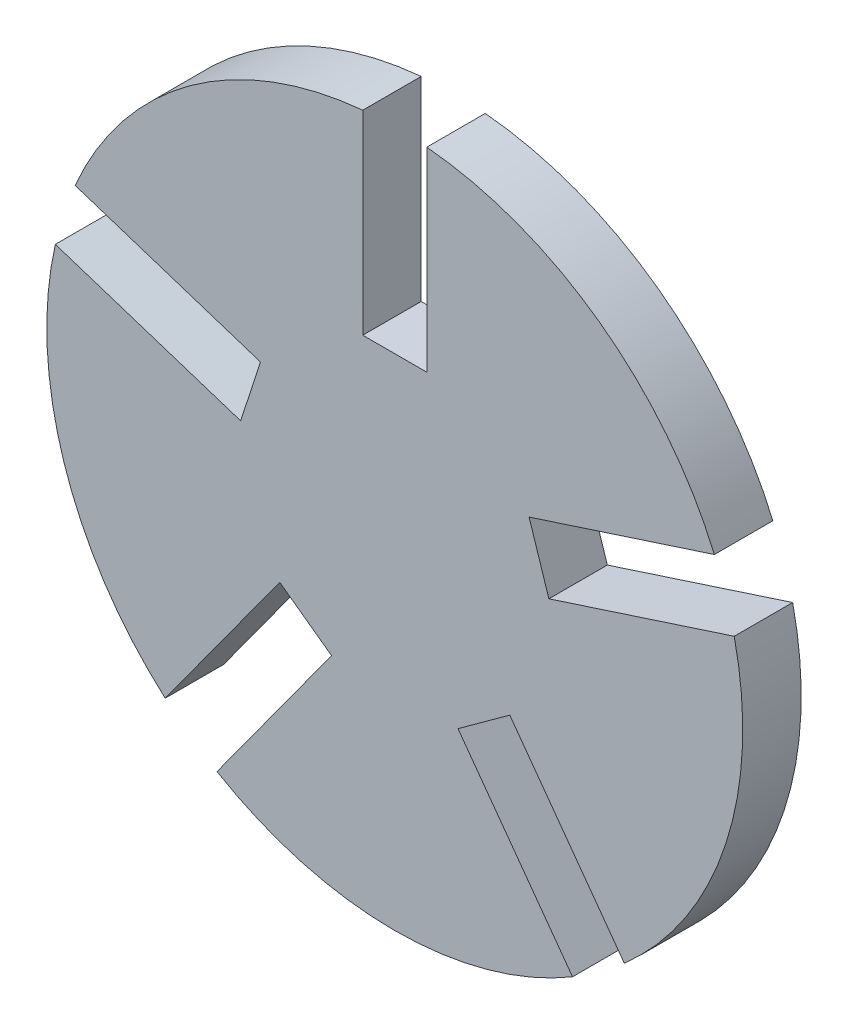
from build123d import *

# Parameters (mm, degrees)
BOSS_EXTRUDE1_DEPTH = 2.1


with BuildPart() as part:
    # Sketch1 → Boss-Extrude1 (new, symmetric)
    with BuildSketch(Plane.XY):
        with BuildLine():
            Line((22.964838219, 9.880091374), (9.650046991, 5.553853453))
            Line((9.650046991, 5.553853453), (11.071525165, 1.178993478))
            Line((11.071525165, 1.178993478), (24.386316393, 5.505231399))
            ThreePointArc((24.386316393, 5.505231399), (23.776412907, -7.725424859), (16.493050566, -18.787742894))
            Line((16.493050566, -18.787742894), (8.264057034, -7.461504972))
            Line((8.264057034, -7.461504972), (4.542578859, -10.165317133))
            Line((4.542578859, -10.165317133), (12.771572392, -21.491555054))
            ThreePointArc((12.771572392, -21.491555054), (0, -25), (-12.771572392, -21.491555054))
            Line((-12.771572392, -21.491555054), (-4.542578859, -10.165317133))
            Line((-4.542578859, -10.165317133), (-8.264057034, -7.461504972))
            Line((-8.264057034, -7.461504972), (-16.493050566, -18.787742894))
            ThreePointArc((-16.493050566, -18.787742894), (-23.776412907, -7.725424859), (-24.386316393, 5.505231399))
            Line((-24.386316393, 5.505231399), (-11.071525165, 1.178993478))
            Line((-11.071525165, 1.178993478), (-9.650046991, 5.553853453))
            Line((-9.650046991, 5.553853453), (-22.964838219, 9.880091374))
            ThreePointArc((-22.964838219, 9.880091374), (-14.694631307, 20.225424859), (-2.3, 24.893975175))
            Line((-2.3, 24.893975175), (-2.3, 10.893975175))
            Line((-2.3, 10.893975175), (2.3, 10.893975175))
            Line((2.3, 10.893975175), (2.3, 24.893975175))
            ThreePointArc((2.3, 24.893975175), (14.694631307, 20.225424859), (22.964838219, 9.880091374))
        make_face()
    extrude(amount=BOSS_EXTRUDE1_DEPTH, both=True)


solid = part.part
